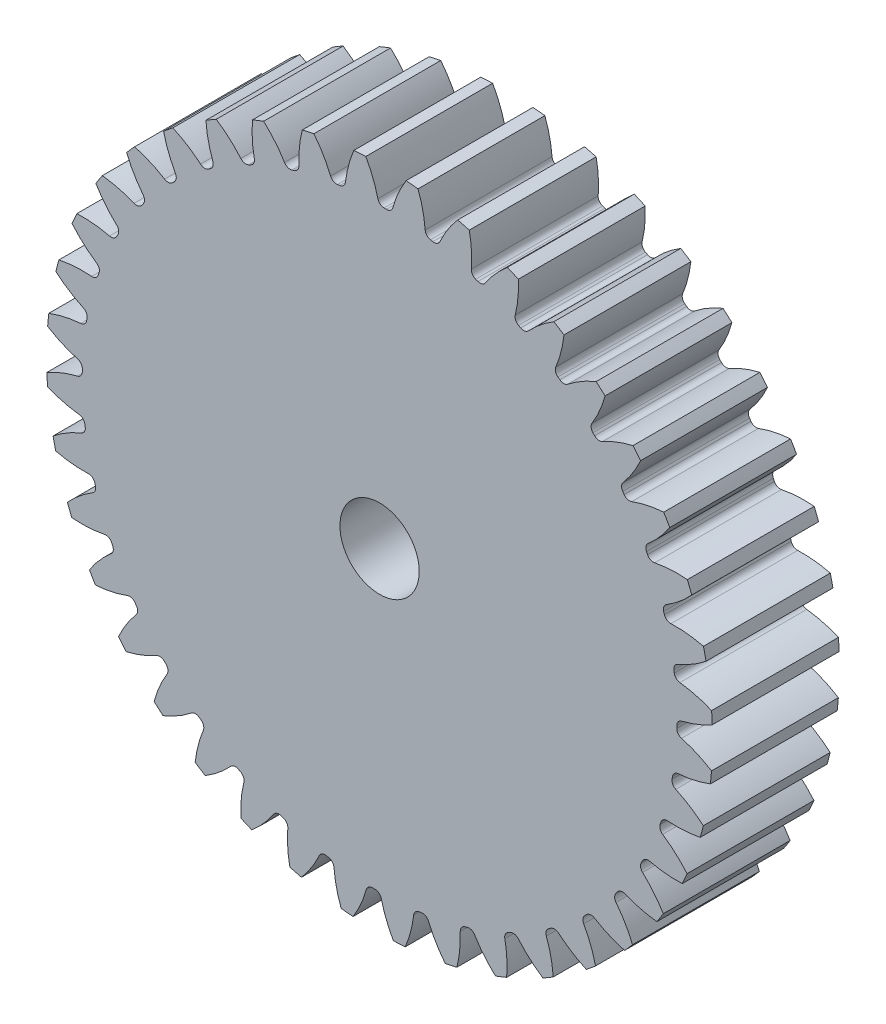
from build123d import *

# Parameters (mm, degrees)
SKETCH3_R         = 266.7
GEARBODY_DEPTH    = 101.6
TOOTHCUT_DEPTH    = 391.61533508
CIRPATTERN1_COUNT = 40
BOREDIA_R         = 31.75
BORE_DEPTH        = 12700


with BuildPart() as part:
    # Sketch3 → gearBody (new body)
    with BuildSketch(Plane.XY):
        Circle(SKETCH3_R)
    extrude(amount=GEARBODY_DEPTH)

    # Sketch2 → toothCut (cut, through all)
    with BuildSketch(Plane.XY):
        with BuildLine():
            ThreePointArc((238.060611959, -5.537206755), (238.081306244, -4.561495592), (238.098001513, -3.585707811))
            ThreePointArc((238.098001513, -3.585707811), (239.232188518, -0.4319248), (242.062425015, 1.36320439))
            ThreePointArc((242.062425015, 1.36320439), (254.734443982, 5.380125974), (266.7, 11.171601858))
            ThreePointArc((266.7, 11.171601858), (266.884897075, -5.113355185), (266.076344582, -21.379278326))
            ThreePointArc((266.076344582, -21.379278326), (254.34141104, -15.133715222), (241.832559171, -10.634343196))
            ThreePointArc((241.832559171, -10.634343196), (239.073161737, -8.732119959), (238.060611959, -5.537206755))
        make_face()
    toothcut = extrude(amount=TOOTHCUT_DEPTH, mode=Mode.SUBTRACT)

    # CirPattern1: toothCut ×40 about axis
    cirpattern1_axis = Axis((0, 0, 0), (0, 0, 1))
    for i in range(1, CIRPATTERN1_COUNT):
        add(toothcut.rotate(cirpattern1_axis, i * 360 / CIRPATTERN1_COUNT), mode=Mode.SUBTRACT)

    # boreDia → bore (cut, symmetric)
    with BuildSketch(Plane.XY):
        Circle(BOREDIA_R)
    extrude(amount=BORE_DEPTH, both=True, mode=Mode.SUBTRACT)


solid = part.part
